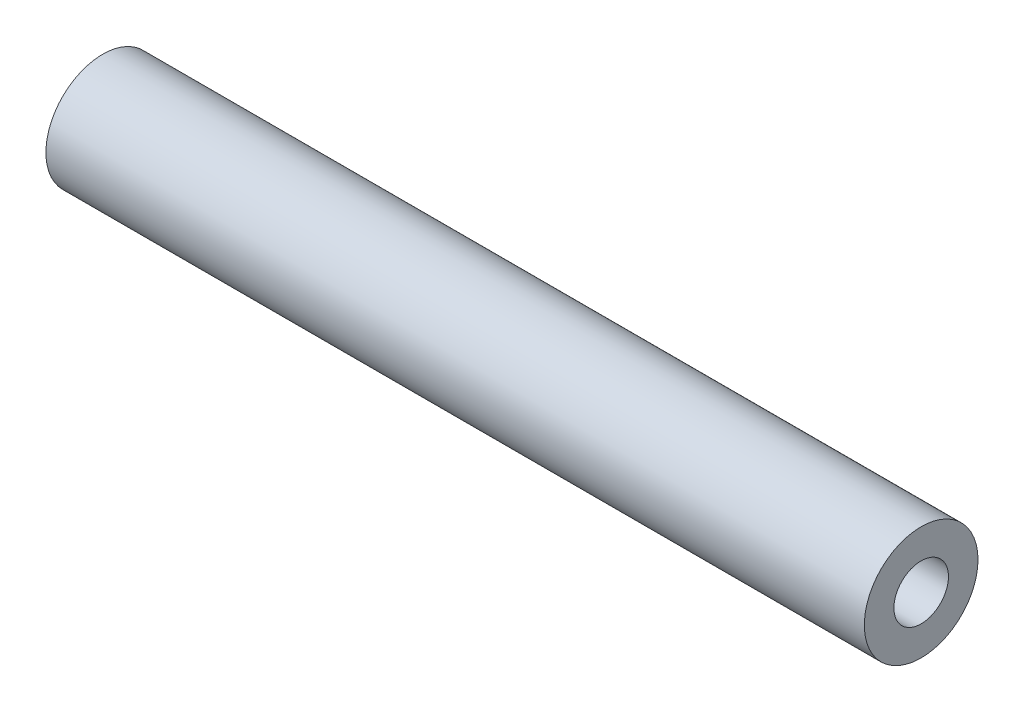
from build123d import *

# Parameters (mm, degrees)
EXTRUSION1_DEPTH                            = 90
EXTRUSION1_DEPTH_BACK                       = 90
ESQUISSE1_R                                 = 12.5
TROU_TARAUD_M12X1_251_D                     = 10.8
TROU_TARAUD_M12X1_251_DEPTH                 = 33.75
TROU_TARAUD_M12X1_251_CBORE_D               = 12
TROU_TARAUD_M12X1_251_CBORE_DEPTH           = 30
TROU_TARAUD_M12X1_251_TIP                   = 3.244647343
TROU_TARAUD_M12X1_251_ON_FACE_2_D           = 10.8
TROU_TARAUD_M12X1_251_ON_FACE_2_DEPTH       = 33.75
TROU_TARAUD_M12X1_251_ON_FACE_2_CBORE_D     = 12
TROU_TARAUD_M12X1_251_ON_FACE_2_CBORE_DEPTH = 30
TROU_TARAUD_M12X1_251_ON_FACE_2_TIP         = 3.244647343
DIAM_TRE_DU_PER_AGE_3_0_3_1_D               = 3
DIAM_TRE_DU_PER_AGE_3_0_3_1_DEPTH           = 72
DIAM_TRE_DU_PER_AGE_3_0_3_1_TIP             = 0.901290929
ESQUISSE4_R                                 = 1.5
ENL_V_MAT_EXTRU_1_DEPTH                     = 12.5


with BuildPart() as part:
    # Esquisse1 → Extrusion1 (new, two sides: drawn at the far end of the back side and taken through both)
    with BuildSketch(Plane(origin=(0, 0, 0), x_dir=(0, 0, -1), z_dir=(1, 0, 0)).offset(-EXTRUSION1_DEPTH_BACK)):
        with Locations(Location((0, 0, 0), (0, 0, 180))):
            Circle(ESQUISSE1_R)
    extrude(amount=EXTRUSION1_DEPTH + EXTRUSION1_DEPTH_BACK)

    # Trou taraud_ M12x1.251
    with Locations(Plane(origin=(90, 0, 0), x_dir=(0, 0, 1), z_dir=(1, 0, 0))):
        with Locations((0, 0)):
            CounterBoreHole(TROU_TARAUD_M12X1_251_D / 2, TROU_TARAUD_M12X1_251_CBORE_D / 2, TROU_TARAUD_M12X1_251_CBORE_DEPTH, depth=TROU_TARAUD_M12X1_251_DEPTH)
            with Locations((0, 0, -(TROU_TARAUD_M12X1_251_DEPTH + TROU_TARAUD_M12X1_251_TIP / 2))):  # 118° drill point
                Cone(0, TROU_TARAUD_M12X1_251_D / 2, TROU_TARAUD_M12X1_251_TIP, mode=Mode.SUBTRACT)

    # Trou taraud_ M12x1.251 on face 2
    with Locations(Plane(origin=(-90, 0, 0), x_dir=(0, 0, -1), z_dir=(-1, 0, 0))):
        with Locations((0, 0)):
            CounterBoreHole(TROU_TARAUD_M12X1_251_ON_FACE_2_D / 2, TROU_TARAUD_M12X1_251_ON_FACE_2_CBORE_D / 2, TROU_TARAUD_M12X1_251_ON_FACE_2_CBORE_DEPTH, depth=TROU_TARAUD_M12X1_251_ON_FACE_2_DEPTH)
            with Locations((0, 0, -(TROU_TARAUD_M12X1_251_ON_FACE_2_DEPTH + TROU_TARAUD_M12X1_251_ON_FACE_2_TIP / 2))):  # 118° drill point
                Cone(0, TROU_TARAUD_M12X1_251_ON_FACE_2_D / 2, TROU_TARAUD_M12X1_251_ON_FACE_2_TIP, mode=Mode.SUBTRACT)

    # Diam_tre du per_age _3.0 _3_1
    with Locations(Plane(origin=(-90, 0, 0), x_dir=(0, 0, -1), z_dir=(-1, 0, 0))):
        with Locations((0, 0)):
            Hole(DIAM_TRE_DU_PER_AGE_3_0_3_1_D / 2, depth=DIAM_TRE_DU_PER_AGE_3_0_3_1_DEPTH)
            with Locations((0, 0, -(DIAM_TRE_DU_PER_AGE_3_0_3_1_DEPTH + DIAM_TRE_DU_PER_AGE_3_0_3_1_TIP / 2))):  # 118° drill point
                Cone(0, DIAM_TRE_DU_PER_AGE_3_0_3_1_D / 2, DIAM_TRE_DU_PER_AGE_3_0_3_1_TIP, mode=Mode.SUBTRACT)

    # Esquisse4 → Enl_v. mat.-Extru.1 (cut)
    with BuildSketch(Plane(origin=(0, 0, 0), x_dir=(1, 0, 0), z_dir=(0, 1, 0))):
        with Locations(Location((-20, 0, 0), (0, 0, 270))):
            Circle(ESQUISSE4_R)
    extrude(amount=-ENL_V_MAT_EXTRU_1_DEPTH, mode=Mode.SUBTRACT)


solid = part.part
